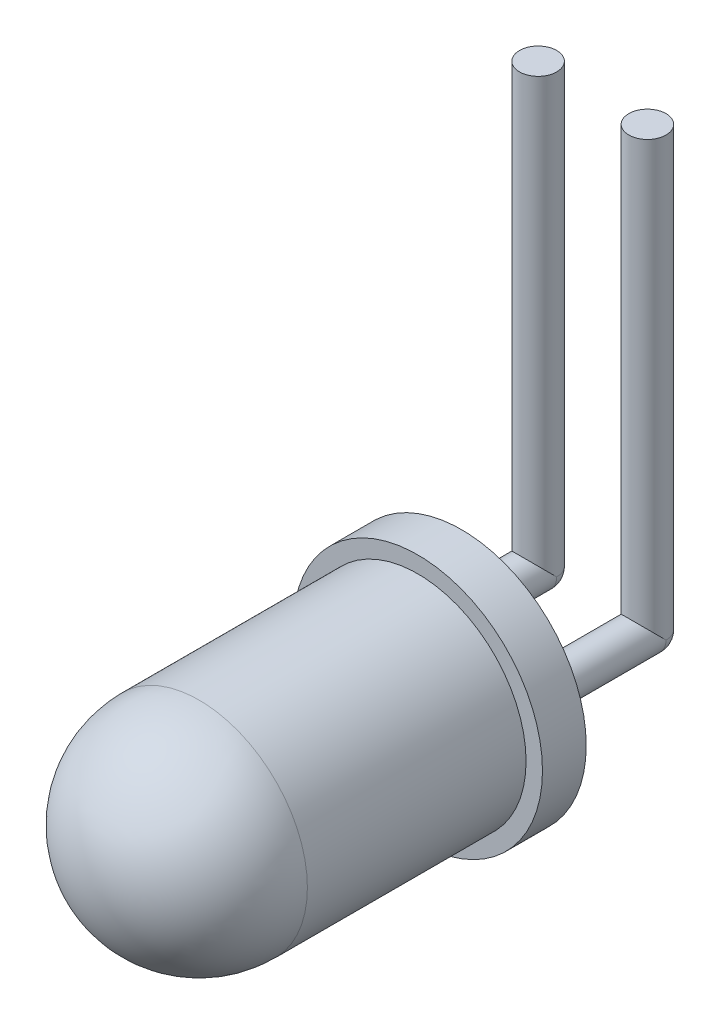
from build123d import *

# Parameters (mm, degrees)
SKETCH_1_R          = 2.8956
EXTRUDE_1_DEPTH     = 1.016
SKETCH_2_R          = 2.5146
EXTRUDE_2_DEPTH     = 5.08
DOME_2_FACE_RADIUS  = 2.5146
DOME_2_HEIGHT       = 2.5146
SKETCH_3_R          = 0.4318
EXTRUDE_3_DEPTH     = 3.048
EXTRUDE_3_2_DEPTH   = 3.048
DOME_9_FACE_RADIUS  = 0.4318
DOME_9_HEIGHT       = 0.4318
DOME_10_FACE_RADIUS = 0.4318
DOME_10_HEIGHT      = 0.4318
F_3DSKETCH2_R       = 0.4318
BOSS_EXTRUDE1_DEPTH = 10.16


with BuildPart() as part:
    # Sketch 1 → Extrude 1 (new body)
    with BuildSketch(Plane.XY):
        Circle(SKETCH_1_R)
    extrude(amount=EXTRUDE_1_DEPTH)

    # Sketch 2 → Extrude 2 (add)
    with BuildSketch(Plane.XY.offset(1.016)):
        Circle(SKETCH_2_R)
    extrude(amount=EXTRUDE_2_DEPTH)

    # Dome 2: a dome of height H over a round flat face of radius A is a cap of a sphere of radius (A * A + H * H) / (2 * H)
    dome_2_r = (DOME_2_FACE_RADIUS * DOME_2_FACE_RADIUS + DOME_2_HEIGHT * DOME_2_HEIGHT) / (2 * DOME_2_HEIGHT)
    dome_2_base = Plane((0, 0, 6.096), z_dir=(0, 0, 1))
    with Locations(dome_2_base.offset(DOME_2_HEIGHT - dome_2_r)):
        dome_2_ball = Sphere(dome_2_r, mode=Mode.PRIVATE)
    add(split(dome_2_ball, bisect_by=dome_2_base, keep=Keep.TOP, mode=Mode.PRIVATE))


with BuildPart() as body_2:
    # Sketch 3 → Extrude 3 (new body)
    with BuildSketch(Plane(origin=(0, 0, 0), x_dir=(-1, 0, 0), z_dir=(0, 0, -1))):
        with Locations((1.27, 0)):
            Circle(SKETCH_3_R)
    extrude(amount=EXTRUDE_3_DEPTH)

    # Dome 9: a dome of height H over a round flat face of radius A is a cap of a sphere of radius (A * A + H * H) / (2 * H)
    dome_9_r = (DOME_9_FACE_RADIUS * DOME_9_FACE_RADIUS + DOME_9_HEIGHT * DOME_9_HEIGHT) / (2 * DOME_9_HEIGHT)
    dome_9_base = Plane((-1.27, 0, -3.048), z_dir=(0, 0, -1))
    with Locations(dome_9_base.offset(DOME_9_HEIGHT - dome_9_r)):
        dome_9_ball = Sphere(dome_9_r, mode=Mode.PRIVATE)
    add(split(dome_9_ball, bisect_by=dome_9_base, keep=Keep.TOP, mode=Mode.PRIVATE))



with BuildPart() as body_3:
    # Sketch 3 → Extrude 3 2 (new body)
    with BuildSketch(Plane(origin=(0, 0, 0), x_dir=(-1, 0, 0), z_dir=(0, 0, -1))):
        with Locations((-1.27, 0)):
            Circle(SKETCH_3_R)
    extrude(amount=EXTRUDE_3_2_DEPTH)

    # Dome 10: a dome of height H over a round flat face of radius A is a cap of a sphere of radius (A * A + H * H) / (2 * H)
    dome_10_r = (DOME_10_FACE_RADIUS * DOME_10_FACE_RADIUS + DOME_10_HEIGHT * DOME_10_HEIGHT) / (2 * DOME_10_HEIGHT)
    dome_10_base = Plane((1.27, 0, -3.048), z_dir=(0, 0, -1))
    with Locations(dome_10_base.offset(DOME_10_HEIGHT - dome_10_r)):
        dome_10_ball = Sphere(dome_10_r, mode=Mode.PRIVATE)
    add(split(dome_10_ball, bisect_by=dome_10_base, keep=Keep.TOP, mode=Mode.PRIVATE))


with BuildPart() as body_2_1:
    add(body_2.part)

    add(body_3.part)  # Boss-Extrude1 merges body 3
    # 3DSketch2 → Boss-Extrude1 (add)
    with BuildSketch(Plane(origin=(1.27, 0, -3.048), x_dir=(-1, 0, 0), z_dir=(0, 1, 0))):
        with Locations(Location((0, 0, 0), (0, 0, 90))):
            Circle(F_3DSKETCH2_R)
        with Locations(Location((2.54, 0, 0), (0, 0, 90))):
            Circle(F_3DSKETCH2_R)
    extrude(amount=BOSS_EXTRUDE1_DEPTH)


solid = Compound([part.part, body_2_1.part])
